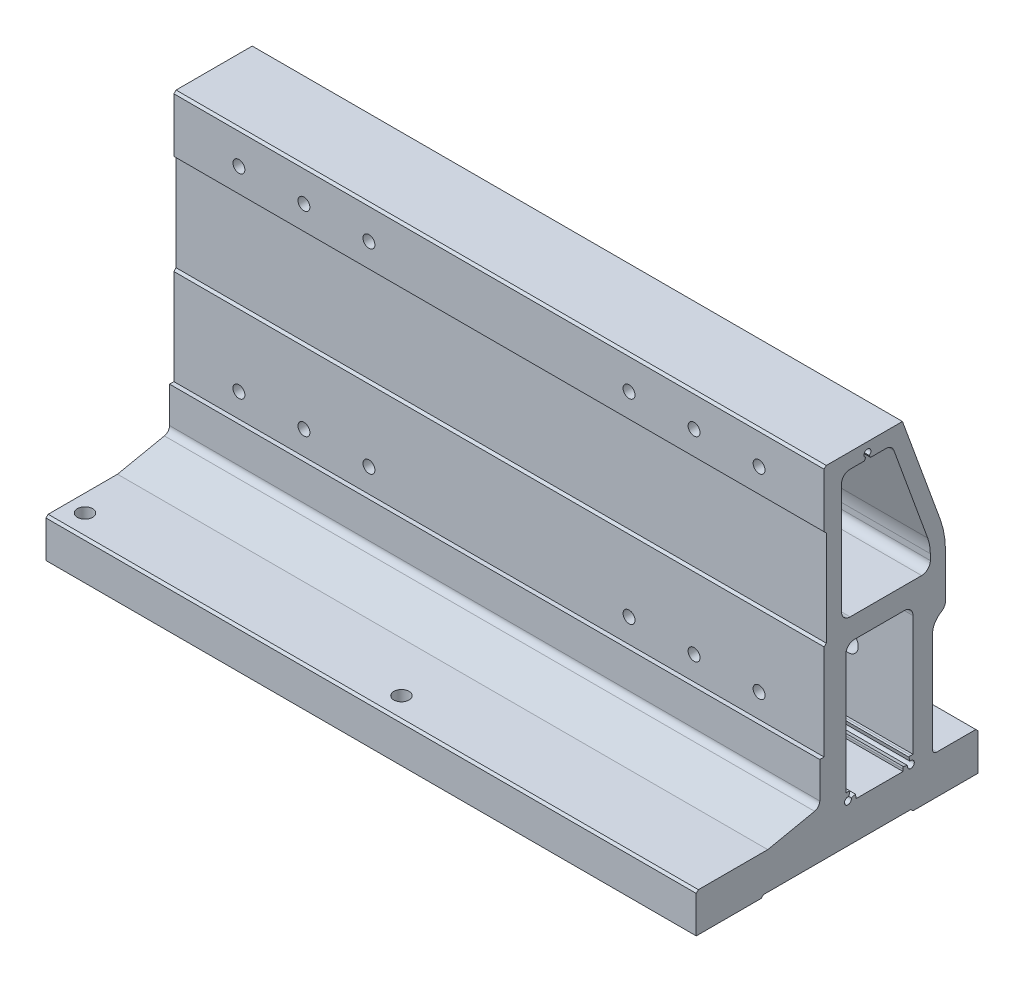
from build123d import *

# Parameters (mm, degrees)
EXTRUDE_1_DEPTH                = 150
HOLE_WIZARD_M5_1_D             = 5.5
HOLE_WIZARD_M5_1_CBORE_D       = 9.5
HOLE_WIZARD_M5_1_CBORE_DEPTH   = 49
PATTERN_LINEAR_1_COUNT         = 2
PATTERN_LINEAR_1_PITCH         = 180
HOLE_WIZARD_M5_1_2_D           = 4.2
HOLE_WIZARD_M5_1_2_DEPTH       = 12
HOLE_WIZARD_M5_1_2_CSINK_D     = 5.05
HOLE_WIZARD_M5_1_2_CSINK_ANGLE = 90
HOLE_WIZARD_M5_1_2_TIP         = 1.2618073
F_5_0MM_1_D                    = 5
F_5_0MM_1_DEPTH                = 10
F_5_0MM_1_TIP                  = 1.502151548
HOLE_WIZARD_7_0_7_1_D          = 7


with BuildPart() as part:
    # Sketch 1 → Extrude 1 (new, symmetric)
    with BuildSketch(Plane(origin=(0, 0, 0), x_dir=(0, 0, -1), z_dir=(1, 0, 0))):
        with BuildLine():
            Line((65, 16), (64, 17))
            Line((64, 17), (46, 17))
            ThreePointArc((46, 17), (44.585786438, 17.585786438), (44, 19))
            Line((44, 19), (44, 65))
            ThreePointArc((44, 65), (45.07179677, 69), (48, 71.92820323))
            ThreePointArc((48, 71.92820323), (49.464101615, 73.392304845), (50, 75.392304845))
            Line((50, 75.392304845), (50, 95.442037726))
            ThreePointArc((50, 95.442037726), (49.391487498, 102.392628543), (47.584464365, 109.131743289))
            Line((47.584464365, 109.131743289), (30.149007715, 156.999997))
            Line((30.149007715, 156.999997), (-5, 156.999997))
            Line((-5, 156.999997), (-6, 155.999997))
            Line((-6, 155.999997), (-6, 131))
            Line((-6, 131), (-5, 130))
            Line((-5, 130), (-5, 86))
            Line((-5, 86), (-6, 85))
            Line((-6, 85), (-6, 40.999831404))
            Line((-6, 40.999831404), (-8, 40.999831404))
            Line((-8, 40.999831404), (-8, 24.439412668))
            ThreePointArc((-8, 24.439412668), (-8.672384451, 22.546741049), (-10.388137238, 21.502471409))
            Line((-10.388137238, 21.502471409), (-32, 17))
            Line((-32, 17), (-64, 17))
            Line((-64, 17), (-65, 16))
            Line((-65, 16), (-65, -1))
            Line((-65, -1), (-35, -1))
            Line((-35, -1), (-34, 0))
            Line((-34, 0), (34, 0))
            Line((34, 0), (35, -1))
            Line((35, -1), (65, -1))
            Line((65, -1), (65, 16))
        make_face()
        with BuildLine():
            Line((2, 146), (2, 95))
            ThreePointArc((2, 95), (3.171572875, 92.171572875), (6, 91))
            Line((6, 91), (39, 91))
            ThreePointArc((39, 91), (41.828427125, 92.171572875), (43, 95))
            Line((43, 95), (43, 97.735875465))
            ThreePointArc((43, 97.735875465), (42.695743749, 101.211170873), (41.792232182, 104.580728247))
            Line((41.792232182, 104.580728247), (26.207110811, 147.368970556))
            ThreePointArc((26.207110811, 147.368970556), (24.742582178, 149.276879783), (22.448664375, 150))
            Line((22.448664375, 150), (15.443373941, 150))
            Line((15.443373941, 150), (14.8, 151.114356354))
            ThreePointArc((14.8, 151.114356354), (14, 154.099997), (13.2, 151.114356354))
            Line((13.2, 151.114356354), (12.556626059, 150))
            Line((12.556626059, 150), (6, 150))
            ThreePointArc((6, 150), (3.171572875, 148.828427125), (2, 146))
        make_face(mode=Mode.SUBTRACT)
        with BuildLine():
            Line((4, 21.6), (4, 77))
            ThreePointArc((4, 77), (5.171572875, 79.828427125), (8, 81))
            Line((8, 81), (31, 81))
            ThreePointArc((31, 81), (33.828427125, 79.828427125), (35, 77))
            Line((35, 77), (35, 21.6))
            Line((35, 21.6), (34, 21.6))
            ThreePointArc((34, 21.6), (33.530105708, 21.569201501), (33.068251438, 21.477332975))
            Line((33.068251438, 21.477332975), (33.585889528, 19.545481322))
            ThreePointArc((33.585889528, 19.545481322), (35.13137085, 16.86862915), (32.454518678, 18.414110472))
            Line((32.454518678, 18.414110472), (30.522667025, 18.931748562))
            ThreePointArc((30.522667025, 18.931748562), (30.430798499, 18.469894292), (30.4, 18))
            Line((30.4, 18), (30.4, 17))
            Line((30.4, 17), (8.6, 17))
            Line((8.6, 17), (8.6, 18))
            ThreePointArc((8.6, 18), (8.569201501, 18.469894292), (8.477332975, 18.931748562))
            Line((8.477332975, 18.931748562), (6.545481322, 18.414110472))
            ThreePointArc((6.545481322, 18.414110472), (3.86862915, 16.86862915), (5.414110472, 19.545481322))
            Line((5.414110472, 19.545481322), (5.931748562, 21.477332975))
            ThreePointArc((5.931748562, 21.477332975), (5.469894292, 21.569201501), (5, 21.6))
            Line((5, 21.6), (4, 21.6))
        make_face(mode=Mode.SUBTRACT)
    extrude(amount=EXTRUDE_1_DEPTH, both=True)

    # Hole Wizard M5 _ _ _ _ _1 (through all)
    with Locations(Plane(origin=(0, 0, -50), x_dir=(-1, 0, 0), z_dir=(0, 0, -1))):
        with Locations((-120, 142), (-90, 142), (-60, 142), (-120, 52), (-90, 52), (-60, 52)):
            hole_wizard_m5_1 = CounterBoreHole(HOLE_WIZARD_M5_1_D / 2, HOLE_WIZARD_M5_1_CBORE_D / 2, HOLE_WIZARD_M5_1_CBORE_DEPTH)

    # Pattern Linear 1: Hole Wizard M5 _ _ _ _ _1 ×2
    with Locations(*[(-i * PATTERN_LINEAR_1_PITCH, 0, 0) for i in range(1, PATTERN_LINEAR_1_COUNT)]):
        add(hole_wizard_m5_1, mode=Mode.SUBTRACT)

    # Hole Wizard M5 _ _1 2
    with Locations(Plane.ZY.offset(150)):
        with Locations((-45, 8), (-9, 8)):
            CounterSinkHole(HOLE_WIZARD_M5_1_2_D / 2, HOLE_WIZARD_M5_1_2_CSINK_D / 2, depth=HOLE_WIZARD_M5_1_2_DEPTH, counter_sink_angle=HOLE_WIZARD_M5_1_2_CSINK_ANGLE)
            with Locations((0, 0, -(HOLE_WIZARD_M5_1_2_DEPTH + HOLE_WIZARD_M5_1_2_TIP / 2))):  # 118° drill point
                Cone(0, HOLE_WIZARD_M5_1_2_D / 2, HOLE_WIZARD_M5_1_2_TIP, mode=Mode.SUBTRACT)

    # 5.0mm _ _1
    with Locations(Plane(origin=(0, 0, 0), x_dir=(-1, 0, 0), z_dir=(0, -1, 0))):
        with Locations((-4, 0), (142, 0)):
            Hole(F_5_0MM_1_D / 2, depth=F_5_0MM_1_DEPTH)
            with Locations((0, 0, -(F_5_0MM_1_DEPTH + F_5_0MM_1_TIP / 2))):  # 118° drill point
                Cone(0, F_5_0MM_1_D / 2, F_5_0MM_1_TIP, mode=Mode.SUBTRACT)

    # Hole Wizard 7.0 _7_ _ _1 (through all)
    with Locations(Plane(origin=(0, -1, 0), x_dir=(-1, 0, 0), z_dir=(0, -1, 0))):
        with Locations((142, -55), (-4, -55), (142, 55), (-4, 55)):
            Hole(HOLE_WIZARD_7_0_7_1_D / 2)


solid = part.part
